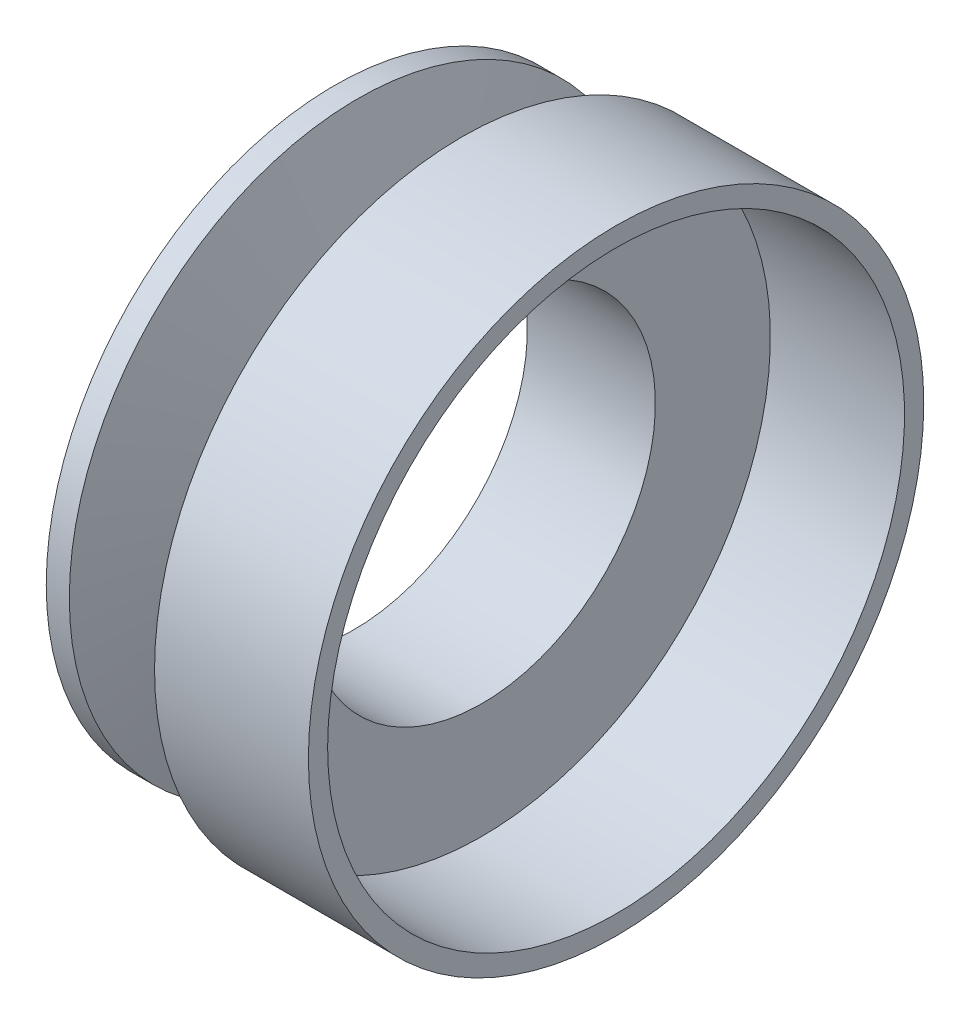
ISO-10303-21;
HEADER;
FILE_DESCRIPTION(('STEP AP214'),'2;1');
FILE_NAME('part.step','',(''),(''),'','','');
FILE_SCHEMA(('AUTOMOTIVE_DESIGN { 1 0 10303 214 1 1 1 1 }'));
ENDSEC;
DATA;
#1=APPLICATION_CONTEXT('core data for automotive mechanical design processes');
#2=APPLICATION_PROTOCOL_DEFINITION('international standard','automotive_design',2000,#1);
#3=PRODUCT_CONTEXT('',#1,'mechanical');
#4=PRODUCT('Part','Part','',(#3));
#5=PRODUCT_RELATED_PRODUCT_CATEGORY('part','',(#4));
#6=PRODUCT_DEFINITION_FORMATION('','',#4);
#7=PRODUCT_DEFINITION_CONTEXT('part definition',#1,'design');
#8=PRODUCT_DEFINITION('design','',#6,#7);
#9=PRODUCT_DEFINITION_SHAPE('','',#8);
#10=(LENGTH_UNIT() NAMED_UNIT(*) SI_UNIT(.MILLI.,.METRE.));
#11=(NAMED_UNIT(*) PLANE_ANGLE_UNIT() SI_UNIT($,.RADIAN.));
#12=(NAMED_UNIT(*) SI_UNIT($,.STERADIAN.) SOLID_ANGLE_UNIT());
#13=UNCERTAINTY_MEASURE_WITH_UNIT(LENGTH_MEASURE(1.E-05),#10,'distance_accuracy_value','');
#14=(GEOMETRIC_REPRESENTATION_CONTEXT(3) GLOBAL_UNCERTAINTY_ASSIGNED_CONTEXT((#13)) GLOBAL_UNIT_ASSIGNED_CONTEXT((#10,
#11,#12)) REPRESENTATION_CONTEXT('',''));
#15=CARTESIAN_POINT('',(0.,0.,0.));
#16=DIRECTION('',(0.,0.,1.));
#17=DIRECTION('',(1.,0.,0.));
#18=AXIS2_PLACEMENT_3D('',#15,#16,#17);
#19=CARTESIAN_POINT('',(6.58,0.,0.));
#20=DIRECTION('',(-1.,0.,0.));
#21=DIRECTION('',(0.,0.,1.));
#22=AXIS2_PLACEMENT_3D('',#19,#20,#21);
#23=CONICAL_SURFACE('',#22,24.15,1.30879579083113);
#24=CARTESIAN_POINT('',(3.,0.,0.));
#25=DIRECTION('',(-1.,0.,0.));
#26=DIRECTION('',(0.,0.,1.));
#27=AXIS2_PLACEMENT_3D('',#24,#25,#26);
#28=CIRCLE('',#27,37.5);
#29=CARTESIAN_POINT('',(3.,0.,37.5));
#30=VERTEX_POINT('',#29);
#31=EDGE_CURVE('E10',#30,#30,#28,.T.);
#32=ORIENTED_EDGE('',*,*,#31,.F.);
#33=EDGE_LOOP('',(#32));
#34=FACE_BOUND('',#33,.T.);
#35=CARTESIAN_POINT('',(6.58,0.,0.));
#36=DIRECTION('',(-1.,0.,0.));
#37=DIRECTION('',(0.,0.,1.));
#38=AXIS2_PLACEMENT_3D('',#35,#36,#37);
#39=CIRCLE('',#38,24.15);
#40=CARTESIAN_POINT('',(6.58,0.,24.15));
#41=VERTEX_POINT('',#40);
#42=EDGE_CURVE('E71',#41,#41,#39,.T.);
#43=ORIENTED_EDGE('',*,*,#42,.T.);
#44=EDGE_LOOP('',(#43));
#45=FACE_BOUND('',#44,.T.);
#46=ADVANCED_FACE('F31',(#34,#45),#23,.T.);
#47=CARTESIAN_POINT('',(0.,0.,0.));
#48=DIRECTION('',(-1.,0.,0.));
#49=DIRECTION('',(0.,0.,1.));
#50=AXIS2_PLACEMENT_3D('',#47,#48,#49);
#51=CYLINDRICAL_SURFACE('',#50,37.5);
#52=CARTESIAN_POINT('',(0.,0.,0.));
#53=DIRECTION('',(-1.,0.,0.));
#54=DIRECTION('',(0.,0.,1.));
#55=AXIS2_PLACEMENT_3D('',#52,#53,#54);
#56=CIRCLE('',#55,37.5);
#57=CARTESIAN_POINT('',(0.,0.,37.5));
#58=VERTEX_POINT('',#57);
#59=EDGE_CURVE('E37',#58,#58,#56,.T.);
#60=ORIENTED_EDGE('',*,*,#59,.F.);
#61=EDGE_LOOP('',(#60));
#62=FACE_BOUND('',#61,.T.);
#63=ORIENTED_EDGE('',*,*,#31,.T.);
#64=EDGE_LOOP('',(#63));
#65=FACE_BOUND('',#64,.T.);
#66=ADVANCED_FACE('F132',(#62,#65),#51,.T.);
#67=CARTESIAN_POINT('',(0.,26.15,0.));
#68=DIRECTION('',(1.,0.,0.));
#69=DIRECTION('',(0.,0.,-1.));
#70=AXIS2_PLACEMENT_3D('',#67,#68,#69);
#71=PLANE('',#70);
#72=CARTESIAN_POINT('',(0.,0.,0.));
#73=DIRECTION('',(-1.,0.,0.));
#74=DIRECTION('',(0.,0.,1.));
#75=AXIS2_PLACEMENT_3D('',#72,#73,#74);
#76=CIRCLE('',#75,26.15);
#77=CARTESIAN_POINT('',(0.,0.,26.15));
#78=VERTEX_POINT('',#77);
#79=EDGE_CURVE('E41',#78,#78,#76,.T.);
#80=ORIENTED_EDGE('',*,*,#79,.F.);
#81=EDGE_LOOP('',(#80));
#82=FACE_BOUND('',#81,.T.);
#83=ORIENTED_EDGE('',*,*,#59,.T.);
#84=EDGE_LOOP('',(#83));
#85=FACE_BOUND('',#84,.T.);
#86=ADVANCED_FACE('F127',(#82,#85),#71,.F.);
#87=CARTESIAN_POINT('',(0.,0.,0.));
#88=DIRECTION('',(-1.,0.,0.));
#89=DIRECTION('',(0.,0.,1.));
#90=AXIS2_PLACEMENT_3D('',#87,#88,#89);
#91=CYLINDRICAL_SURFACE('',#90,26.15);
#92=CARTESIAN_POINT('',(2.5,0.,0.));
#93=DIRECTION('',(-1.,0.,0.));
#94=DIRECTION('',(0.,0.,1.));
#95=AXIS2_PLACEMENT_3D('',#92,#93,#94);
#96=CIRCLE('',#95,26.15);
#97=CARTESIAN_POINT('',(2.5,0.,26.15));
#98=VERTEX_POINT('',#97);
#99=EDGE_CURVE('E45',#98,#98,#96,.T.);
#100=ORIENTED_EDGE('',*,*,#99,.F.);
#101=EDGE_LOOP('',(#100));
#102=FACE_BOUND('',#101,.T.);
#103=ORIENTED_EDGE('',*,*,#79,.T.);
#104=EDGE_LOOP('',(#103));
#105=FACE_BOUND('',#104,.T.);
#106=ADVANCED_FACE('F121',(#102,#105),#91,.F.);
#107=CARTESIAN_POINT('',(2.5,26.15,0.));
#108=DIRECTION('',(1.,0.,0.));
#109=DIRECTION('',(0.,0.,-1.));
#110=AXIS2_PLACEMENT_3D('',#107,#108,#109);
#111=PLANE('',#110);
#112=CARTESIAN_POINT('',(2.5,0.,0.));
#113=DIRECTION('',(-1.,0.,0.));
#114=DIRECTION('',(0.,0.,1.));
#115=AXIS2_PLACEMENT_3D('',#112,#113,#114);
#116=CIRCLE('',#115,22.55);
#117=CARTESIAN_POINT('',(2.5,0.,22.55));
#118=VERTEX_POINT('',#117);
#119=EDGE_CURVE('E50',#118,#118,#116,.T.);
#120=ORIENTED_EDGE('',*,*,#119,.F.);
#121=EDGE_LOOP('',(#120));
#122=FACE_BOUND('',#121,.T.);
#123=ORIENTED_EDGE('',*,*,#99,.T.);
#124=EDGE_LOOP('',(#123));
#125=FACE_BOUND('',#124,.T.);
#126=ADVANCED_FACE('F115',(#122,#125),#111,.F.);
#127=CARTESIAN_POINT('',(0.,0.,0.));
#128=DIRECTION('',(-1.,0.,0.));
#129=DIRECTION('',(0.,0.,1.));
#130=AXIS2_PLACEMENT_3D('',#127,#128,#129);
#131=CYLINDRICAL_SURFACE('',#130,22.55);
#132=CARTESIAN_POINT('',(19.14,0.,0.));
#133=DIRECTION('',(-1.,0.,0.));
#134=DIRECTION('',(0.,0.,1.));
#135=AXIS2_PLACEMENT_3D('',#132,#133,#134);
#136=CIRCLE('',#135,22.55);
#137=CARTESIAN_POINT('',(19.14,0.,22.55));
#138=VERTEX_POINT('',#137);
#139=EDGE_CURVE('E53',#138,#138,#136,.T.);
#140=ORIENTED_EDGE('',*,*,#139,.F.);
#141=EDGE_LOOP('',(#140));
#142=FACE_BOUND('',#141,.T.);
#143=ORIENTED_EDGE('',*,*,#119,.T.);
#144=EDGE_LOOP('',(#143));
#145=FACE_BOUND('',#144,.T.);
#146=ADVANCED_FACE('F109',(#142,#145),#131,.F.);
#147=CARTESIAN_POINT('',(19.14,37.5,0.));
#148=DIRECTION('',(-1.,0.,0.));
#149=DIRECTION('',(0.,0.,1.));
#150=AXIS2_PLACEMENT_3D('',#147,#148,#149);
#151=PLANE('',#150);
#152=CARTESIAN_POINT('',(19.14,0.,0.));
#153=DIRECTION('',(-1.,0.,0.));
#154=DIRECTION('',(0.,0.,1.));
#155=AXIS2_PLACEMENT_3D('',#152,#153,#154);
#156=CIRCLE('',#155,37.5);
#157=CARTESIAN_POINT('',(19.14,0.,37.5));
#158=VERTEX_POINT('',#157);
#159=EDGE_CURVE('E56',#158,#158,#156,.T.);
#160=ORIENTED_EDGE('',*,*,#159,.F.);
#161=EDGE_LOOP('',(#160));
#162=FACE_BOUND('',#161,.T.);
#163=ORIENTED_EDGE('',*,*,#139,.T.);
#164=EDGE_LOOP('',(#163));
#165=FACE_BOUND('',#164,.T.);
#166=ADVANCED_FACE('F103',(#162,#165),#151,.F.);
#167=CARTESIAN_POINT('',(0.,0.,0.));
#168=DIRECTION('',(-1.,0.,0.));
#169=DIRECTION('',(0.,0.,1.));
#170=AXIS2_PLACEMENT_3D('',#167,#168,#169);
#171=CYLINDRICAL_SURFACE('',#170,37.5);
#172=CARTESIAN_POINT('',(36.58,0.,0.));
#173=DIRECTION('',(-1.,0.,0.));
#174=DIRECTION('',(0.,0.,1.));
#175=AXIS2_PLACEMENT_3D('',#172,#173,#174);
#176=CIRCLE('',#175,37.5);
#177=CARTESIAN_POINT('',(36.58,0.,37.5));
#178=VERTEX_POINT('',#177);
#179=EDGE_CURVE('E59',#178,#178,#176,.T.);
#180=ORIENTED_EDGE('',*,*,#179,.F.);
#181=EDGE_LOOP('',(#180));
#182=FACE_BOUND('',#181,.T.);
#183=ORIENTED_EDGE('',*,*,#159,.T.);
#184=EDGE_LOOP('',(#183));
#185=FACE_BOUND('',#184,.T.);
#186=ADVANCED_FACE('F97',(#182,#185),#171,.F.);
#187=CARTESIAN_POINT('',(36.58,40.,0.));
#188=DIRECTION('',(-1.,0.,0.));
#189=DIRECTION('',(0.,0.,1.));
#190=AXIS2_PLACEMENT_3D('',#187,#188,#189);
#191=PLANE('',#190);
#192=CARTESIAN_POINT('',(36.58,0.,0.));
#193=DIRECTION('',(-1.,0.,0.));
#194=DIRECTION('',(0.,0.,1.));
#195=AXIS2_PLACEMENT_3D('',#192,#193,#194);
#196=CIRCLE('',#195,40.);
#197=CARTESIAN_POINT('',(36.58,0.,40.));
#198=VERTEX_POINT('',#197);
#199=EDGE_CURVE('E62',#198,#198,#196,.T.);
#200=ORIENTED_EDGE('',*,*,#199,.F.);
#201=EDGE_LOOP('',(#200));
#202=FACE_BOUND('',#201,.T.);
#203=ORIENTED_EDGE('',*,*,#179,.T.);
#204=EDGE_LOOP('',(#203));
#205=FACE_BOUND('',#204,.T.);
#206=ADVANCED_FACE('F91',(#202,#205),#191,.F.);
#207=CARTESIAN_POINT('',(0.,0.,0.));
#208=DIRECTION('',(-1.,0.,0.));
#209=DIRECTION('',(0.,0.,1.));
#210=AXIS2_PLACEMENT_3D('',#207,#208,#209);
#211=CYLINDRICAL_SURFACE('',#210,40.);
#212=CARTESIAN_POINT('',(16.58,0.,0.));
#213=DIRECTION('',(-1.,0.,0.));
#214=DIRECTION('',(0.,0.,1.));
#215=AXIS2_PLACEMENT_3D('',#212,#213,#214);
#216=CIRCLE('',#215,40.);
#217=CARTESIAN_POINT('',(16.58,0.,40.));
#218=VERTEX_POINT('',#217);
#219=EDGE_CURVE('E65',#218,#218,#216,.T.);
#220=ORIENTED_EDGE('',*,*,#219,.F.);
#221=EDGE_LOOP('',(#220));
#222=FACE_BOUND('',#221,.T.);
#223=ORIENTED_EDGE('',*,*,#199,.T.);
#224=EDGE_LOOP('',(#223));
#225=FACE_BOUND('',#224,.T.);
#226=ADVANCED_FACE('F85',(#222,#225),#211,.T.);
#227=CARTESIAN_POINT('',(16.58,24.15,0.));
#228=DIRECTION('',(1.,0.,0.));
#229=DIRECTION('',(0.,0.,-1.));
#230=AXIS2_PLACEMENT_3D('',#227,#228,#229);
#231=PLANE('',#230);
#232=CARTESIAN_POINT('',(16.58,0.,0.));
#233=DIRECTION('',(-1.,0.,0.));
#234=DIRECTION('',(0.,0.,1.));
#235=AXIS2_PLACEMENT_3D('',#232,#233,#234);
#236=CIRCLE('',#235,24.15);
#237=CARTESIAN_POINT('',(16.58,0.,24.15));
#238=VERTEX_POINT('',#237);
#239=EDGE_CURVE('E68',#238,#238,#236,.T.);
#240=ORIENTED_EDGE('',*,*,#239,.F.);
#241=EDGE_LOOP('',(#240));
#242=FACE_BOUND('',#241,.T.);
#243=ORIENTED_EDGE('',*,*,#219,.T.);
#244=EDGE_LOOP('',(#243));
#245=FACE_BOUND('',#244,.T.);
#246=ADVANCED_FACE('F79',(#242,#245),#231,.F.);
#247=CARTESIAN_POINT('',(0.,0.,0.));
#248=DIRECTION('',(-1.,0.,0.));
#249=DIRECTION('',(0.,0.,1.));
#250=AXIS2_PLACEMENT_3D('',#247,#248,#249);
#251=CYLINDRICAL_SURFACE('',#250,24.15);
#252=ORIENTED_EDGE('',*,*,#42,.F.);
#253=EDGE_LOOP('',(#252));
#254=FACE_BOUND('',#253,.T.);
#255=ORIENTED_EDGE('',*,*,#239,.T.);
#256=EDGE_LOOP('',(#255));
#257=FACE_BOUND('',#256,.T.);
#258=ADVANCED_FACE('F76',(#254,#257),#251,.T.);
#259=CLOSED_SHELL('',(#46,#66,#86,#106,#126,#146,#166,#186,#206,#226,#246,#258));
#260=MANIFOLD_SOLID_BREP('B2',#259);
#261=ADVANCED_BREP_SHAPE_REPRESENTATION('',(#18,#260),#14);
#262=SHAPE_DEFINITION_REPRESENTATION(#9,#261);
ENDSEC;
END-ISO-10303-21;
